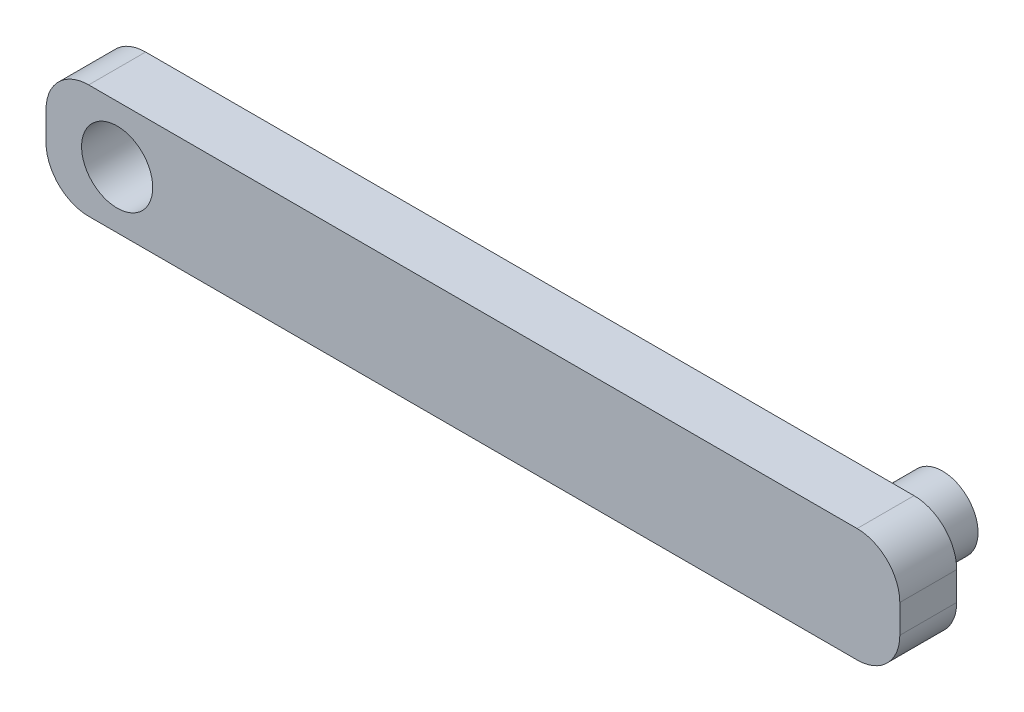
from build123d import *

# Parameters (mm, degrees)
EXTRUSION1_DEPTH        = 20
ESQUISSE2_R             = 12.5
ENL_V_MAT_EXTRU_1_DEPTH = 1014.672969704
ESQUISSE3_R             = 12.5
EXTRUSION2_DEPTH        = 20


with BuildPart() as part:
    # Esquisse1 → Extrusion1 (new body)
    with BuildSketch(Plane.XY):
        with BuildLine():
            Line((726.866139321, 57.094707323), (996.866139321, 57.094707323))
            ThreePointArc((996.866139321, 57.094707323), (1007.472741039, 52.701309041), (1011.866139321, 42.094707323))
            Line((1011.866139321, 42.094707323), (1011.866139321, 32.094707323))
            ThreePointArc((1011.866139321, 32.094707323), (1007.472741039, 21.488105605), (996.866139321, 17.094707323))
            Line((996.866139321, 17.094707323), (726.866139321, 17.094707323))
            ThreePointArc((726.866139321, 17.094707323), (716.259537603, 21.488105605), (711.866139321, 32.094707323))
            Line((711.866139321, 32.094707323), (711.866139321, 42.094707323))
            ThreePointArc((711.866139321, 42.094707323), (716.259537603, 52.701309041), (726.866139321, 57.094707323))
        make_face()
    extrude(amount=EXTRUSION1_DEPTH)

    # Esquisse2 → Enl_v. mat.-Extru.1 (cut, through all)
    with BuildSketch(Plane.XY.offset(20)):
        with Locations((736.866139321, 37.094707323)):
            Circle(ESQUISSE2_R)
    extrude(amount=-ENL_V_MAT_EXTRU_1_DEPTH, mode=Mode.SUBTRACT)

    # Esquisse3 → Extrusion2 (add)
    with BuildSketch(Plane(origin=(0, 0, 0), x_dir=(-1, 0, 0), z_dir=(0, 0, -1))):
        with Locations((-986.866139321, 37.094707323)):
            Circle(ESQUISSE3_R)
    extrude(amount=EXTRUSION2_DEPTH)


solid = part.part
